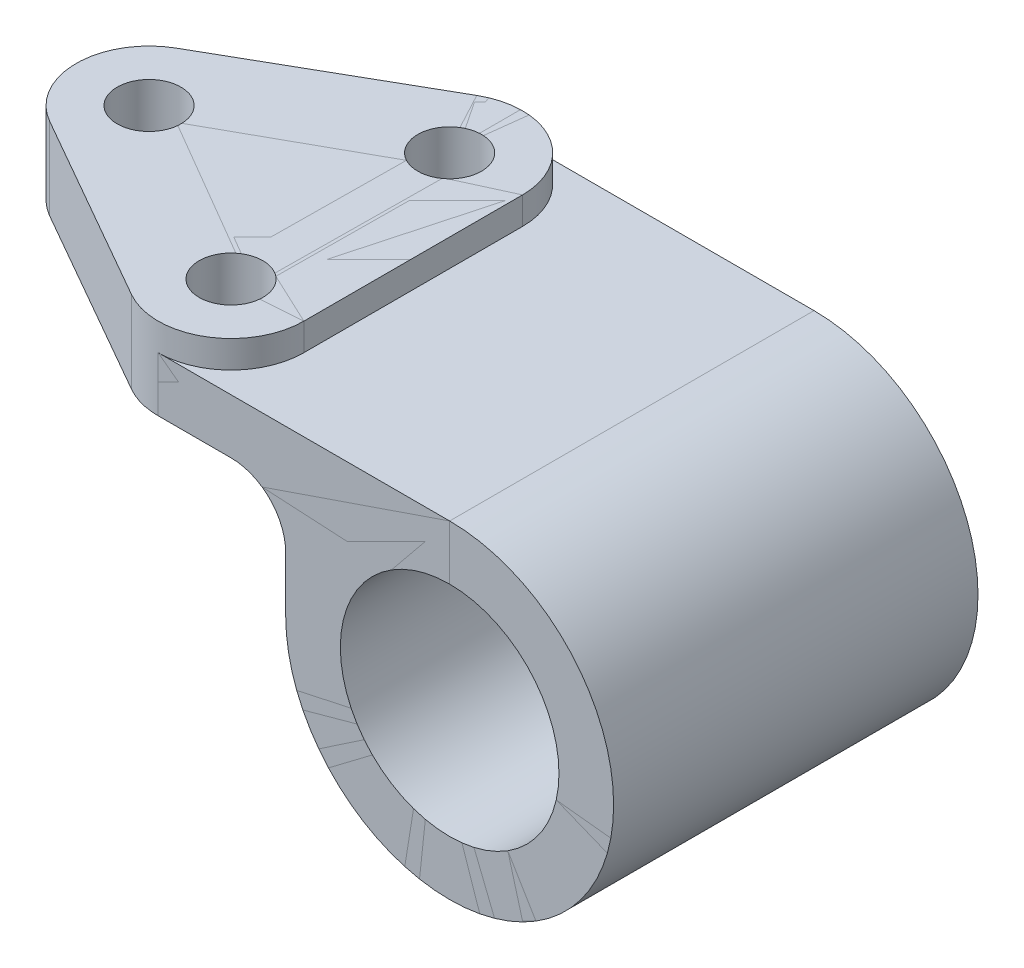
from build123d import *

# Parameters (mm, degrees)
BASE_EXTRUDE_DEPTH  = 31.75
BOSS_EXTRUDE1_REACH = 125.141
CUT_EXTRUDE1_DEPTH  = 38.1
SKETCH4_R           = 5.55625
CUT_EXTRUDE2_DEPTH  = 120.242280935
SKETCH5_R           = 19.05
CUT_EXTRUDE3_DEPTH  = 121.503694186


with BuildPart() as part:
    # Sketch1 → Base-Extrude (new, symmetric)
    with BuildSketch(Plane.XY):
        with BuildLine():
            Line((-101.6, 28.575), (0, 28.575))
            ThreePointArc((0, 28.575), (20.205576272, -20.205576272), (-28.575, 0))
            Line((-28.575, 0), (-28.575, 9.525))
            ThreePointArc((-28.575, 9.525), (-31.364807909, 16.260192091), (-38.1, 19.05))
            Line((-38.1, 19.05), (-101.6, 19.05))
            Line((-101.6, 19.05), (-101.6, 28.575))
        make_face()
    extrude(amount=BASE_EXTRUDE_DEPTH, both=True)

    # Sketch2 → Boss-Extrude1 (add, up to next)
    with BuildSketch(Plane(origin=(0, 33.3375, 0), x_dir=(-1, 0, 0), z_dir=(0, 1, 0)), mode=Mode.PRIVATE) as boss_extrude1_sk1:
        with BuildLine():
            Line((90.438464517, -11.026687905), (57.100964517, -30.076687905))
            ThreePointArc((57.100964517, -30.076687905), (44.425529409, -30.034358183), (38.1, -19.05))
            Line((38.1, -19.05), (38.1, 19.05))
            ThreePointArc((38.1, 19.05), (44.425529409, 30.034358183), (57.100964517, 30.076687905))
            Line((57.100964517, 30.076687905), (90.438464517, 11.026687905))
            ThreePointArc((90.438464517, 11.026687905), (96.8375, 0), (90.438464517, -11.026687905))
        make_face()
    boss_extrude1_tool1 = extrude(boss_extrude1_sk1.sketch, amount=-BOSS_EXTRUDE1_REACH, mode=Mode.PRIVATE) - part.part
    add(boss_extrude1_tool1.solids().sort_by_distance((-61.937794, 33.3375, 0))[0])

    # Sketch3 → Cut-Extrude1 (cut)
    with BuildSketch(Plane(origin=(0, 28.575, 0), x_dir=(-1, 0, 0), z_dir=(0, 1, 0))):
        with BuildLine():
            Line((90.438464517, -11.026687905), (57.100964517, -30.076687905))
            ThreePointArc((57.100964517, -30.076687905), (54.059682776, -31.324545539), (50.8, -31.75))
            Line((50.8, -31.75), (101.6, -31.75))
            Line((101.6, -31.75), (101.6, 31.75))
            Line((101.6, 31.75), (50.8, 31.75))
            ThreePointArc((50.8, 31.75), (54.059682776, 31.324545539), (57.100964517, 30.076687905))
            Line((57.100964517, 30.076687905), (90.438464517, 11.026687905))
            ThreePointArc((90.438464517, 11.026687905), (96.8375, 0), (90.438464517, -11.026687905))
        make_face()
    extrude(amount=-CUT_EXTRUDE1_DEPTH, mode=Mode.SUBTRACT)

    # Sketch4 → Cut-Extrude2 (cut, through all)
    with BuildSketch(Plane(origin=(0, 33.3375, 0), x_dir=(-1, 0, 0), z_dir=(0, 1, 0))):
        with Locations(Location((50.8, 19.05, 0), (0, 0, 90))):
            Circle(SKETCH4_R)
        with Locations(Location((50.8, -19.05, 0), (0, 0, 90))):
            Circle(SKETCH4_R)
        with Locations(Location((84.1375, 0, 0), (0, 0, 90))):
            Circle(SKETCH4_R)
    extrude(amount=-CUT_EXTRUDE2_DEPTH, mode=Mode.SUBTRACT)

    # Sketch5 → Cut-Extrude3 (cut, through all)
    with BuildSketch(Plane.XY.offset(31.75)):
        Circle(SKETCH5_R)
    extrude(amount=-CUT_EXTRUDE3_DEPTH, mode=Mode.SUBTRACT)


solid = part.part
